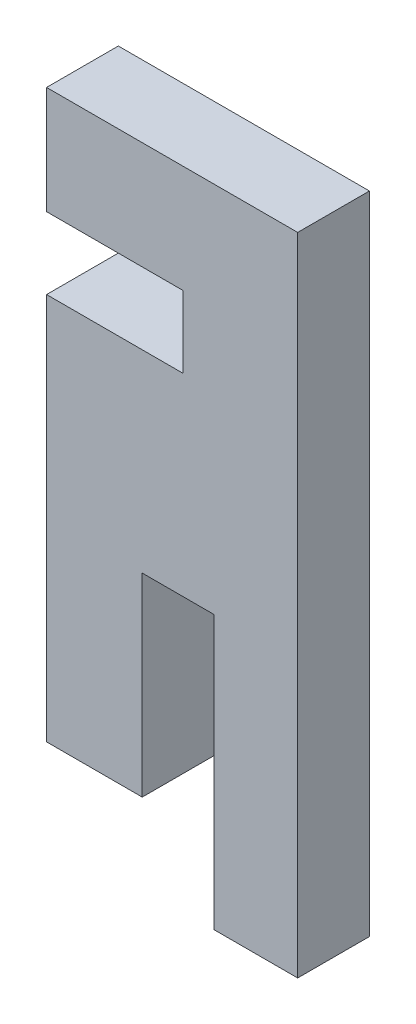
ISO-10303-21;
HEADER;
FILE_DESCRIPTION(('STEP AP214'),'2;1');
FILE_NAME('part.step','',(''),(''),'','','');
FILE_SCHEMA(('AUTOMOTIVE_DESIGN { 1 0 10303 214 1 1 1 1 }'));
ENDSEC;
DATA;
#1=APPLICATION_CONTEXT('core data for automotive mechanical design processes');
#2=APPLICATION_PROTOCOL_DEFINITION('international standard','automotive_design',2000,#1);
#3=PRODUCT_CONTEXT('',#1,'mechanical');
#4=PRODUCT('Part','Part','',(#3));
#5=PRODUCT_RELATED_PRODUCT_CATEGORY('part','',(#4));
#6=PRODUCT_DEFINITION_FORMATION('','',#4);
#7=PRODUCT_DEFINITION_CONTEXT('part definition',#1,'design');
#8=PRODUCT_DEFINITION('design','',#6,#7);
#9=PRODUCT_DEFINITION_SHAPE('','',#8);
#10=(LENGTH_UNIT() NAMED_UNIT(*) SI_UNIT(.MILLI.,.METRE.));
#11=(NAMED_UNIT(*) PLANE_ANGLE_UNIT() SI_UNIT($,.RADIAN.));
#12=(NAMED_UNIT(*) SI_UNIT($,.STERADIAN.) SOLID_ANGLE_UNIT());
#13=UNCERTAINTY_MEASURE_WITH_UNIT(LENGTH_MEASURE(1.E-05),#10,'distance_accuracy_value','');
#14=(GEOMETRIC_REPRESENTATION_CONTEXT(3) GLOBAL_UNCERTAINTY_ASSIGNED_CONTEXT((#13)) GLOBAL_UNIT_ASSIGNED_CONTEXT((#10,
#11,#12)) REPRESENTATION_CONTEXT('',''));
#15=CARTESIAN_POINT('',(0.,0.,0.));
#16=DIRECTION('',(0.,0.,1.));
#17=DIRECTION('',(1.,0.,0.));
#18=AXIS2_PLACEMENT_3D('',#15,#16,#17);
#19=CARTESIAN_POINT('',(-5.25,0.,3.));
#20=DIRECTION('',(-1.,0.,0.));
#21=DIRECTION('',(0.,0.,1.));
#22=AXIS2_PLACEMENT_3D('',#19,#20,#21);
#23=PLANE('',#22);
#24=DIRECTION('',(0.,1.,0.));
#25=VECTOR('',#24,1.);
#26=CARTESIAN_POINT('',(-5.25,0.,0.));
#27=LINE('',#26,#25);
#28=CARTESIAN_POINT('',(-5.25,9.,0.));
#29=VERTEX_POINT('',#28);
#30=CARTESIAN_POINT('',(-5.25,13.5,0.));
#31=VERTEX_POINT('',#30);
#32=EDGE_CURVE('E168',#29,#31,#27,.T.);
#33=ORIENTED_EDGE('',*,*,#32,.F.);
#34=DIRECTION('',(0.,0.,-1.));
#35=VECTOR('',#34,1.);
#36=CARTESIAN_POINT('',(-5.25,9.,3.));
#37=LINE('',#36,#35);
#38=CARTESIAN_POINT('',(-5.25,9.,3.));
#39=VERTEX_POINT('',#38);
#40=EDGE_CURVE('E11',#39,#29,#37,.T.);
#41=ORIENTED_EDGE('',*,*,#40,.F.);
#42=DIRECTION('',(0.,1.,0.));
#43=VECTOR('',#42,1.);
#44=CARTESIAN_POINT('',(-5.25,0.,3.));
#45=LINE('',#44,#43);
#46=CARTESIAN_POINT('',(-5.25,13.5,3.));
#47=VERTEX_POINT('',#46);
#48=EDGE_CURVE('E210',#39,#47,#45,.T.);
#49=ORIENTED_EDGE('',*,*,#48,.T.);
#50=DIRECTION('',(0.,0.,-1.));
#51=VECTOR('',#50,1.);
#52=CARTESIAN_POINT('',(-5.25,13.5,3.));
#53=LINE('',#52,#51);
#54=EDGE_CURVE('E62',#47,#31,#53,.T.);
#55=ORIENTED_EDGE('',*,*,#54,.T.);
#56=EDGE_LOOP('',(#33,#41,#49,#55));
#57=FACE_BOUND('',#56,.T.);
#58=ADVANCED_FACE('F45',(#57),#23,.T.);
#59=CARTESIAN_POINT('',(0.,9.,3.));
#60=DIRECTION('',(0.,1.,0.));
#61=DIRECTION('',(0.,0.,1.));
#62=AXIS2_PLACEMENT_3D('',#59,#60,#61);
#63=PLANE('',#62);
#64=DIRECTION('',(1.,0.,0.));
#65=VECTOR('',#64,1.);
#66=CARTESIAN_POINT('',(0.,9.,0.));
#67=LINE('',#66,#65);
#68=CARTESIAN_POINT('',(0.45,9.,0.));
#69=VERTEX_POINT('',#68);
#70=EDGE_CURVE('E171',#29,#69,#67,.T.);
#71=ORIENTED_EDGE('',*,*,#70,.T.);
#72=DIRECTION('',(0.,0.,-1.));
#73=VECTOR('',#72,1.);
#74=CARTESIAN_POINT('',(0.45,9.,3.));
#75=LINE('',#74,#73);
#76=CARTESIAN_POINT('',(0.45,9.,3.));
#77=VERTEX_POINT('',#76);
#78=EDGE_CURVE('E54',#77,#69,#75,.T.);
#79=ORIENTED_EDGE('',*,*,#78,.F.);
#80=DIRECTION('',(1.,0.,0.));
#81=VECTOR('',#80,1.);
#82=CARTESIAN_POINT('',(0.,9.,3.));
#83=LINE('',#82,#81);
#84=EDGE_CURVE('E264',#39,#77,#83,.T.);
#85=ORIENTED_EDGE('',*,*,#84,.F.);
#86=ORIENTED_EDGE('',*,*,#40,.T.);
#87=EDGE_LOOP('',(#71,#79,#85,#86));
#88=FACE_BOUND('',#87,.T.);
#89=ADVANCED_FACE('F293',(#88),#63,.F.);
#90=CARTESIAN_POINT('',(0.45,0.,3.));
#91=DIRECTION('',(1.,0.,0.));
#92=DIRECTION('',(0.,0.,-1.));
#93=AXIS2_PLACEMENT_3D('',#90,#91,#92);
#94=PLANE('',#93);
#95=DIRECTION('',(0.,-1.,0.));
#96=VECTOR('',#95,1.);
#97=CARTESIAN_POINT('',(0.45,0.,0.));
#98=LINE('',#97,#96);
#99=CARTESIAN_POINT('',(0.45,6.,0.));
#100=VERTEX_POINT('',#99);
#101=EDGE_CURVE('E174',#69,#100,#98,.T.);
#102=ORIENTED_EDGE('',*,*,#101,.T.);
#103=DIRECTION('',(0.,0.,-1.));
#104=VECTOR('',#103,1.);
#105=CARTESIAN_POINT('',(0.45,6.,3.));
#106=LINE('',#105,#104);
#107=CARTESIAN_POINT('',(0.45,6.,3.));
#108=VERTEX_POINT('',#107);
#109=EDGE_CURVE('E233',#108,#100,#106,.T.);
#110=ORIENTED_EDGE('',*,*,#109,.F.);
#111=DIRECTION('',(0.,-1.,0.));
#112=VECTOR('',#111,1.);
#113=CARTESIAN_POINT('',(0.45,0.,3.));
#114=LINE('',#113,#112);
#115=EDGE_CURVE('E243',#77,#108,#114,.T.);
#116=ORIENTED_EDGE('',*,*,#115,.F.);
#117=ORIENTED_EDGE('',*,*,#78,.T.);
#118=EDGE_LOOP('',(#102,#110,#116,#117));
#119=FACE_BOUND('',#118,.T.);
#120=ADVANCED_FACE('F241',(#119),#94,.F.);
#121=CARTESIAN_POINT('',(0.,6.,3.));
#122=DIRECTION('',(0.,1.,0.));
#123=DIRECTION('',(-1.,0.,0.));
#124=AXIS2_PLACEMENT_3D('',#121,#122,#123);
#125=PLANE('',#124);
#126=DIRECTION('',(1.,0.,0.));
#127=VECTOR('',#126,1.);
#128=CARTESIAN_POINT('',(0.,6.,0.));
#129=LINE('',#128,#127);
#130=CARTESIAN_POINT('',(-5.25,6.,0.));
#131=VERTEX_POINT('',#130);
#132=EDGE_CURVE('E178',#131,#100,#129,.T.);
#133=ORIENTED_EDGE('',*,*,#132,.F.);
#134=DIRECTION('',(0.,0.,-1.));
#135=VECTOR('',#134,1.);
#136=CARTESIAN_POINT('',(-5.25,6.,3.));
#137=LINE('',#136,#135);
#138=CARTESIAN_POINT('',(-5.25,6.,3.));
#139=VERTEX_POINT('',#138);
#140=EDGE_CURVE('E230',#139,#131,#137,.T.);
#141=ORIENTED_EDGE('',*,*,#140,.F.);
#142=DIRECTION('',(1.,0.,0.));
#143=VECTOR('',#142,1.);
#144=CARTESIAN_POINT('',(0.,6.,3.));
#145=LINE('',#144,#143);
#146=EDGE_CURVE('E256',#139,#108,#145,.T.);
#147=ORIENTED_EDGE('',*,*,#146,.T.);
#148=ORIENTED_EDGE('',*,*,#109,.T.);
#149=EDGE_LOOP('',(#133,#141,#147,#148));
#150=FACE_BOUND('',#149,.T.);
#151=ADVANCED_FACE('F252',(#150),#125,.T.);
#152=CARTESIAN_POINT('',(-5.25,0.,3.));
#153=DIRECTION('',(1.,0.,0.));
#154=DIRECTION('',(0.,1.,0.));
#155=AXIS2_PLACEMENT_3D('',#152,#153,#154);
#156=PLANE('',#155);
#157=DIRECTION('',(0.,-1.,0.));
#158=VECTOR('',#157,1.);
#159=CARTESIAN_POINT('',(-5.25,0.,0.));
#160=LINE('',#159,#158);
#161=CARTESIAN_POINT('',(-5.25,-10.2,0.));
#162=VERTEX_POINT('',#161);
#163=EDGE_CURVE('E182',#131,#162,#160,.T.);
#164=ORIENTED_EDGE('',*,*,#163,.T.);
#165=DIRECTION('',(0.,0.,-1.));
#166=VECTOR('',#165,1.);
#167=CARTESIAN_POINT('',(-5.25,-10.2,3.));
#168=LINE('',#167,#166);
#169=CARTESIAN_POINT('',(-5.25,-10.2,3.));
#170=VERTEX_POINT('',#169);
#171=EDGE_CURVE('E226',#170,#162,#168,.T.);
#172=ORIENTED_EDGE('',*,*,#171,.F.);
#173=DIRECTION('',(0.,-1.,0.));
#174=VECTOR('',#173,1.);
#175=CARTESIAN_POINT('',(-5.25,0.,3.));
#176=LINE('',#175,#174);
#177=EDGE_CURVE('E258',#139,#170,#176,.T.);
#178=ORIENTED_EDGE('',*,*,#177,.F.);
#179=ORIENTED_EDGE('',*,*,#140,.T.);
#180=EDGE_LOOP('',(#164,#172,#178,#179));
#181=FACE_BOUND('',#180,.T.);
#182=ADVANCED_FACE('F304',(#181),#156,.F.);
#183=CARTESIAN_POINT('',(0.,-10.2,3.));
#184=DIRECTION('',(0.,1.,0.));
#185=DIRECTION('',(0.,0.,1.));
#186=AXIS2_PLACEMENT_3D('',#183,#184,#185);
#187=PLANE('',#186);
#188=DIRECTION('',(1.,0.,0.));
#189=VECTOR('',#188,1.);
#190=CARTESIAN_POINT('',(0.,-10.2,0.));
#191=LINE('',#190,#189);
#192=CARTESIAN_POINT('',(-1.25,-10.2,0.));
#193=VERTEX_POINT('',#192);
#194=EDGE_CURVE('E185',#162,#193,#191,.T.);
#195=ORIENTED_EDGE('',*,*,#194,.T.);
#196=DIRECTION('',(0.,0.,-1.));
#197=VECTOR('',#196,1.);
#198=CARTESIAN_POINT('',(-1.25,-10.2,3.));
#199=LINE('',#198,#197);
#200=CARTESIAN_POINT('',(-1.25,-10.2,3.));
#201=VERTEX_POINT('',#200);
#202=EDGE_CURVE('E223',#201,#193,#199,.T.);
#203=ORIENTED_EDGE('',*,*,#202,.F.);
#204=DIRECTION('',(1.,0.,0.));
#205=VECTOR('',#204,1.);
#206=CARTESIAN_POINT('',(0.,-10.2,3.));
#207=LINE('',#206,#205);
#208=EDGE_CURVE('E262',#170,#201,#207,.T.);
#209=ORIENTED_EDGE('',*,*,#208,.F.);
#210=ORIENTED_EDGE('',*,*,#171,.T.);
#211=EDGE_LOOP('',(#195,#203,#209,#210));
#212=FACE_BOUND('',#211,.T.);
#213=ADVANCED_FACE('F307',(#212),#187,.F.);
#214=CARTESIAN_POINT('',(-1.25,0.,3.));
#215=DIRECTION('',(1.,0.,0.));
#216=DIRECTION('',(0.,1.,0.));
#217=AXIS2_PLACEMENT_3D('',#214,#215,#216);
#218=PLANE('',#217);
#219=DIRECTION('',(0.,-1.,0.));
#220=VECTOR('',#219,1.);
#221=CARTESIAN_POINT('',(-1.25,0.,0.));
#222=LINE('',#221,#220);
#223=CARTESIAN_POINT('',(-1.25,-2.08557042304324,0.));
#224=VERTEX_POINT('',#223);
#225=EDGE_CURVE('E189',#224,#193,#222,.T.);
#226=ORIENTED_EDGE('',*,*,#225,.F.);
#227=DIRECTION('',(0.,0.,-1.));
#228=VECTOR('',#227,1.);
#229=CARTESIAN_POINT('',(-1.25,-2.08557042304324,3.));
#230=LINE('',#229,#228);
#231=CARTESIAN_POINT('',(-1.25,-2.08557042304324,3.));
#232=VERTEX_POINT('',#231);
#233=EDGE_CURVE('E220',#232,#224,#230,.T.);
#234=ORIENTED_EDGE('',*,*,#233,.F.);
#235=DIRECTION('',(0.,-1.,0.));
#236=VECTOR('',#235,1.);
#237=CARTESIAN_POINT('',(-1.25,0.,3.));
#238=LINE('',#237,#236);
#239=EDGE_CURVE('E270',#232,#201,#238,.T.);
#240=ORIENTED_EDGE('',*,*,#239,.T.);
#241=ORIENTED_EDGE('',*,*,#202,.T.);
#242=EDGE_LOOP('',(#226,#234,#240,#241));
#243=FACE_BOUND('',#242,.T.);
#244=ADVANCED_FACE('F311',(#243),#218,.T.);
#245=CARTESIAN_POINT('',(0.,-2.08557042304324,3.));
#246=DIRECTION('',(0.,-1.,0.));
#247=DIRECTION('',(0.,0.,-1.));
#248=AXIS2_PLACEMENT_3D('',#245,#246,#247);
#249=PLANE('',#248);
#250=DIRECTION('',(-1.,0.,0.));
#251=VECTOR('',#250,1.);
#252=CARTESIAN_POINT('',(0.,-2.08557042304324,0.));
#253=LINE('',#252,#251);
#254=CARTESIAN_POINT('',(1.75,-2.08557042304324,0.));
#255=VERTEX_POINT('',#254);
#256=EDGE_CURVE('E193',#255,#224,#253,.T.);
#257=ORIENTED_EDGE('',*,*,#256,.F.);
#258=DIRECTION('',(0.,0.,-1.));
#259=VECTOR('',#258,1.);
#260=CARTESIAN_POINT('',(1.75,-2.08557042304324,3.));
#261=LINE('',#260,#259);
#262=CARTESIAN_POINT('',(1.75,-2.08557042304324,3.));
#263=VERTEX_POINT('',#262);
#264=EDGE_CURVE('E217',#263,#255,#261,.T.);
#265=ORIENTED_EDGE('',*,*,#264,.F.);
#266=DIRECTION('',(-1.,0.,0.));
#267=VECTOR('',#266,1.);
#268=CARTESIAN_POINT('',(0.,-2.08557042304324,3.));
#269=LINE('',#268,#267);
#270=EDGE_CURVE('E274',#263,#232,#269,.T.);
#271=ORIENTED_EDGE('',*,*,#270,.T.);
#272=ORIENTED_EDGE('',*,*,#233,.T.);
#273=EDGE_LOOP('',(#257,#265,#271,#272));
#274=FACE_BOUND('',#273,.T.);
#275=ADVANCED_FACE('F315',(#274),#249,.T.);
#276=CARTESIAN_POINT('',(1.75,0.,3.));
#277=DIRECTION('',(-1.,0.,0.));
#278=DIRECTION('',(0.,-1.,0.));
#279=AXIS2_PLACEMENT_3D('',#276,#277,#278);
#280=PLANE('',#279);
#281=DIRECTION('',(0.,1.,0.));
#282=VECTOR('',#281,1.);
#283=CARTESIAN_POINT('',(1.75,0.,0.));
#284=LINE('',#283,#282);
#285=CARTESIAN_POINT('',(1.75,-13.5,0.));
#286=VERTEX_POINT('',#285);
#287=EDGE_CURVE('E197',#286,#255,#284,.T.);
#288=ORIENTED_EDGE('',*,*,#287,.F.);
#289=DIRECTION('',(0.,0.,-1.));
#290=VECTOR('',#289,1.);
#291=CARTESIAN_POINT('',(1.75,-13.5,3.));
#292=LINE('',#291,#290);
#293=CARTESIAN_POINT('',(1.75,-13.5,3.));
#294=VERTEX_POINT('',#293);
#295=EDGE_CURVE('E158',#294,#286,#292,.T.);
#296=ORIENTED_EDGE('',*,*,#295,.F.);
#297=DIRECTION('',(0.,1.,0.));
#298=VECTOR('',#297,1.);
#299=CARTESIAN_POINT('',(1.75,0.,3.));
#300=LINE('',#299,#298);
#301=EDGE_CURVE('E146',#294,#263,#300,.T.);
#302=ORIENTED_EDGE('',*,*,#301,.T.);
#303=ORIENTED_EDGE('',*,*,#264,.T.);
#304=EDGE_LOOP('',(#288,#296,#302,#303));
#305=FACE_BOUND('',#304,.T.);
#306=ADVANCED_FACE('F280',(#305),#280,.T.);
#307=CARTESIAN_POINT('',(0.,-13.5,3.));
#308=DIRECTION('',(0.,1.,0.));
#309=DIRECTION('',(-1.,0.,0.));
#310=AXIS2_PLACEMENT_3D('',#307,#308,#309);
#311=PLANE('',#310);
#312=DIRECTION('',(1.,0.,0.));
#313=VECTOR('',#312,1.);
#314=CARTESIAN_POINT('',(0.,-13.5,0.));
#315=LINE('',#314,#313);
#316=CARTESIAN_POINT('',(5.25,-13.5,0.));
#317=VERTEX_POINT('',#316);
#318=EDGE_CURVE('E154',#286,#317,#315,.T.);
#319=ORIENTED_EDGE('',*,*,#318,.T.);
#320=DIRECTION('',(0.,0.,-1.));
#321=VECTOR('',#320,1.);
#322=CARTESIAN_POINT('',(5.25,-13.5,3.));
#323=LINE('',#322,#321);
#324=CARTESIAN_POINT('',(5.25,-13.5,3.));
#325=VERTEX_POINT('',#324);
#326=EDGE_CURVE('E151',#325,#317,#323,.T.);
#327=ORIENTED_EDGE('',*,*,#326,.F.);
#328=DIRECTION('',(1.,0.,0.));
#329=VECTOR('',#328,1.);
#330=CARTESIAN_POINT('',(0.,-13.5,3.));
#331=LINE('',#330,#329);
#332=EDGE_CURVE('E137',#294,#325,#331,.T.);
#333=ORIENTED_EDGE('',*,*,#332,.F.);
#334=ORIENTED_EDGE('',*,*,#295,.T.);
#335=EDGE_LOOP('',(#319,#327,#333,#334));
#336=FACE_BOUND('',#335,.T.);
#337=ADVANCED_FACE('F152',(#336),#311,.F.);
#338=CARTESIAN_POINT('',(5.25,0.,3.));
#339=DIRECTION('',(-1.,0.,0.));
#340=DIRECTION('',(0.,0.,1.));
#341=AXIS2_PLACEMENT_3D('',#338,#339,#340);
#342=PLANE('',#341);
#343=DIRECTION('',(0.,1.,0.));
#344=VECTOR('',#343,1.);
#345=CARTESIAN_POINT('',(5.25,0.,0.));
#346=LINE('',#345,#344);
#347=CARTESIAN_POINT('',(5.25,13.5,0.));
#348=VERTEX_POINT('',#347);
#349=EDGE_CURVE('E203',#317,#348,#346,.T.);
#350=ORIENTED_EDGE('',*,*,#349,.T.);
#351=DIRECTION('',(0.,0.,-1.));
#352=VECTOR('',#351,1.);
#353=CARTESIAN_POINT('',(5.25,13.5,3.));
#354=LINE('',#353,#352);
#355=CARTESIAN_POINT('',(5.25,13.5,3.));
#356=VERTEX_POINT('',#355);
#357=EDGE_CURVE('E100',#356,#348,#354,.T.);
#358=ORIENTED_EDGE('',*,*,#357,.F.);
#359=DIRECTION('',(0.,1.,0.));
#360=VECTOR('',#359,1.);
#361=CARTESIAN_POINT('',(5.25,0.,3.));
#362=LINE('',#361,#360);
#363=EDGE_CURVE('E143',#325,#356,#362,.T.);
#364=ORIENTED_EDGE('',*,*,#363,.F.);
#365=ORIENTED_EDGE('',*,*,#326,.T.);
#366=EDGE_LOOP('',(#350,#358,#364,#365));
#367=FACE_BOUND('',#366,.T.);
#368=ADVANCED_FACE('F160',(#367),#342,.F.);
#369=CARTESIAN_POINT('',(0.,13.5,3.));
#370=DIRECTION('',(0.,1.,0.));
#371=DIRECTION('',(0.,0.,1.));
#372=AXIS2_PLACEMENT_3D('',#369,#370,#371);
#373=PLANE('',#372);
#374=DIRECTION('',(1.,0.,0.));
#375=VECTOR('',#374,1.);
#376=CARTESIAN_POINT('',(0.,13.5,0.));
#377=LINE('',#376,#375);
#378=EDGE_CURVE('E206',#31,#348,#377,.T.);
#379=ORIENTED_EDGE('',*,*,#378,.F.);
#380=ORIENTED_EDGE('',*,*,#54,.F.);
#381=DIRECTION('',(1.,0.,0.));
#382=VECTOR('',#381,1.);
#383=CARTESIAN_POINT('',(0.,13.5,3.));
#384=LINE('',#383,#382);
#385=EDGE_CURVE('E162',#47,#356,#384,.T.);
#386=ORIENTED_EDGE('',*,*,#385,.T.);
#387=ORIENTED_EDGE('',*,*,#357,.T.);
#388=EDGE_LOOP('',(#379,#380,#386,#387));
#389=FACE_BOUND('',#388,.T.);
#390=ADVANCED_FACE('F282',(#389),#373,.T.);
#391=CARTESIAN_POINT('',(0.,0.,3.));
#392=DIRECTION('',(0.,0.,1.));
#393=DIRECTION('',(1.,0.,0.));
#394=AXIS2_PLACEMENT_3D('',#391,#392,#393);
#395=PLANE('',#394);
#396=ORIENTED_EDGE('',*,*,#48,.F.);
#397=ORIENTED_EDGE('',*,*,#84,.T.);
#398=ORIENTED_EDGE('',*,*,#115,.T.);
#399=ORIENTED_EDGE('',*,*,#146,.F.);
#400=ORIENTED_EDGE('',*,*,#177,.T.);
#401=ORIENTED_EDGE('',*,*,#208,.T.);
#402=ORIENTED_EDGE('',*,*,#239,.F.);
#403=ORIENTED_EDGE('',*,*,#270,.F.);
#404=ORIENTED_EDGE('',*,*,#301,.F.);
#405=ORIENTED_EDGE('',*,*,#332,.T.);
#406=ORIENTED_EDGE('',*,*,#363,.T.);
#407=ORIENTED_EDGE('',*,*,#385,.F.);
#408=EDGE_LOOP('',(#396,#397,#398,#399,#400,#401,#402,#403,#404,#405,#406,#407));
#409=FACE_BOUND('',#408,.T.);
#410=ADVANCED_FACE('F140',(#409),#395,.T.);
#411=CARTESIAN_POINT('',(0.,0.,0.));
#412=DIRECTION('',(0.,0.,1.));
#413=DIRECTION('',(1.,0.,0.));
#414=AXIS2_PLACEMENT_3D('',#411,#412,#413);
#415=PLANE('',#414);
#416=ORIENTED_EDGE('',*,*,#32,.T.);
#417=ORIENTED_EDGE('',*,*,#378,.T.);
#418=ORIENTED_EDGE('',*,*,#349,.F.);
#419=ORIENTED_EDGE('',*,*,#318,.F.);
#420=ORIENTED_EDGE('',*,*,#287,.T.);
#421=ORIENTED_EDGE('',*,*,#256,.T.);
#422=ORIENTED_EDGE('',*,*,#225,.T.);
#423=ORIENTED_EDGE('',*,*,#194,.F.);
#424=ORIENTED_EDGE('',*,*,#163,.F.);
#425=ORIENTED_EDGE('',*,*,#132,.T.);
#426=ORIENTED_EDGE('',*,*,#101,.F.);
#427=ORIENTED_EDGE('',*,*,#70,.F.);
#428=EDGE_LOOP('',(#416,#417,#418,#419,#420,#421,#422,#423,#424,#425,#426,#427));
#429=FACE_BOUND('',#428,.T.);
#430=ADVANCED_FACE('F247',(#429),#415,.F.);
#431=CLOSED_SHELL('',(#58,#89,#120,#151,#182,#213,#244,#275,#306,#337,#368,#390,#410,#430));
#432=MANIFOLD_SOLID_BREP('B2',#431);
#433=ADVANCED_BREP_SHAPE_REPRESENTATION('',(#18,#432),#14);
#434=SHAPE_DEFINITION_REPRESENTATION(#9,#433);
ENDSEC;
END-ISO-10303-21;
